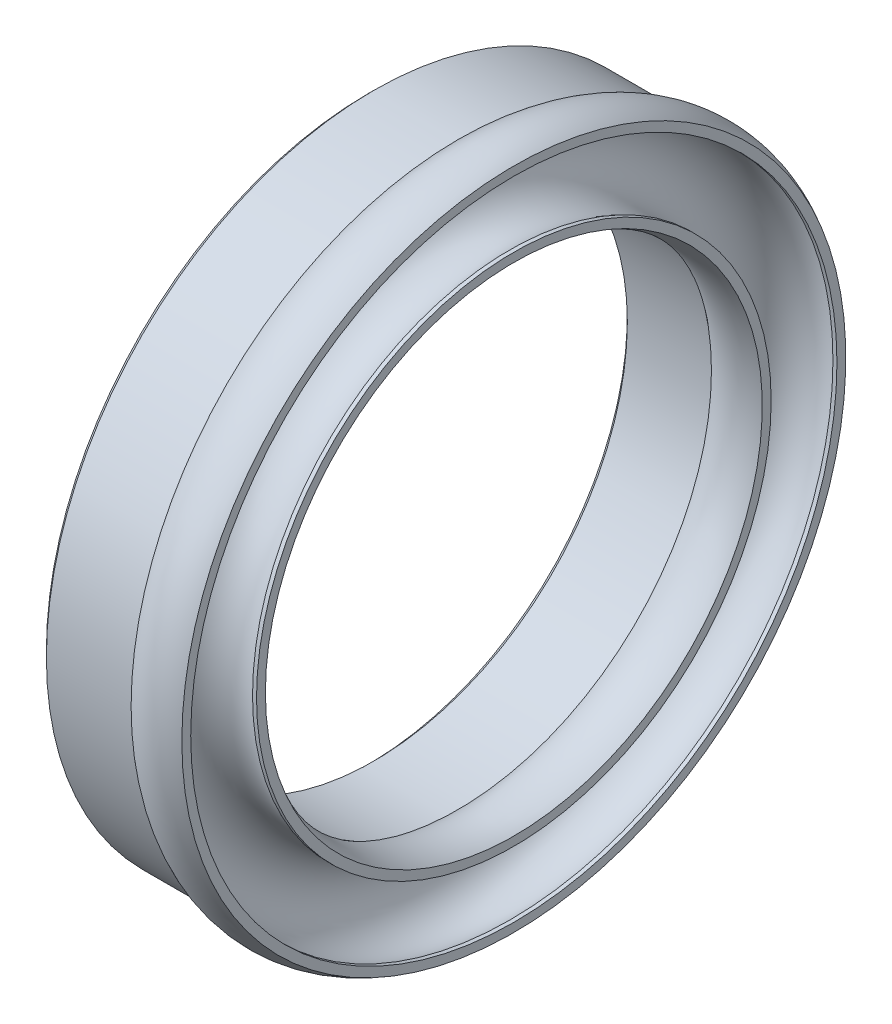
from build123d import *


with BuildPart() as part:
    # Sketch1 → Base-Revolve (revolve)
    with BuildSketch(Plane.XY, mode=Mode.PRIVATE) as base_revolve_sk:
        with BuildLine():
            Line((2.938121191, 8.322903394), (0.1778, 8.322903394))
            Line((0.1778, 8.322903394), (0, 8.500703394))
            Line((0, 8.500703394), (0, 10.566682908))
            Line((0, 10.566682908), (0.1778, 10.744482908))
            Line((0.1778, 10.744482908), (2.95862635, 10.744482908))
            ThreePointArc((2.95862635, 10.744482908), (3.842986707, 11.107001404), (4.7752, 10.896071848))
            Line((4.7752, 10.896071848), (4.7752, 10.6045))
            Line((4.7752, 10.6045), (4.644015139, 10.6045))
            ThreePointArc((4.644015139, 10.6045), (2.705001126, 9.525), (4.644015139, 8.4455))
            Line((4.644015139, 8.4455), (4.7752, 8.4455))
            Line((4.7752, 8.4455), (4.7752, 8.153928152))
            ThreePointArc((4.7752, 8.153928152), (3.829596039, 7.944173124), (2.938121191, 8.322903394))
        make_face()
    revolve(base_revolve_sk.sketch.rotate(Axis((0, 0, 0), (1, 0, 0)), 90), axis=Axis((0, 0, 0), (1, 0, 0)))


solid = part.part
